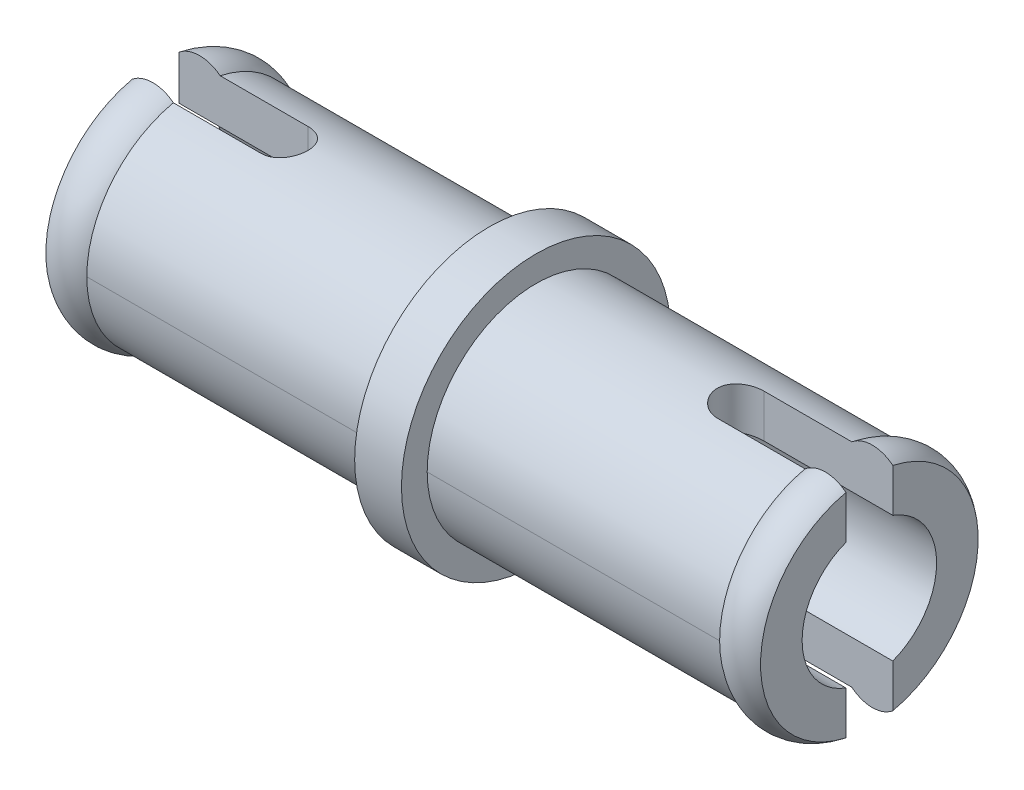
from build123d import *

# Parameters (mm, degrees)
SKETCH1_R           = 2.3622
BASE_EXTRUDE_DEPTH  = 7.239
SKETCH3_R           = 2.921
BOSS_EXTRUDE1_DEPTH = 1.016
SKETCH4_R           = 2.3876
BOSS_EXTRUDE2_DEPTH = 7.239
SKETCH7_R           = 1.4605
CUT_EXTRUDE2_DEPTH  = 17.035227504
CUT_EXTRUDE4_DEPTH  = 10.230899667


with BuildPart() as part:
    # Sketch1 → Base-Extrude (new body)
    with BuildSketch(Plane(origin=(0, 0, 0), x_dir=(0, 0, -1), z_dir=(1, 0, 0))):
        Circle(SKETCH1_R)
    extrude(amount=BASE_EXTRUDE_DEPTH)

    # Sketch3 → Boss-Extrude1 (add)
    with BuildSketch(Plane.ZY):
        Circle(SKETCH3_R)
    extrude(amount=BOSS_EXTRUDE1_DEPTH)

    # Sketch4 → Boss-Extrude2 (add)
    with BuildSketch(Plane.ZY.offset(1.016)):
        Circle(SKETCH4_R)
    extrude(amount=BOSS_EXTRUDE2_DEPTH)

    # Sketch6 → Boss-Revolve2 (revolve)
    with BuildSketch(Plane(origin=(0, 0, 0), x_dir=(1, 0, 0), z_dir=(0, 1, 0)), mode=Mode.PRIVATE) as boss_revolve2_sk:
        with BuildLine():
            Line((-8.255, 2.3876), (-7.366, 2.3876))
            ThreePointArc((-7.366, 2.3876), (-7.8105, 2.54), (-8.255, 2.3876))
        make_face()
    revolve(boss_revolve2_sk.sketch.rotate(Axis((0, 0, 0), (-1, 0, 0)), 180), axis=Axis((0, 0, 0), (-1, 0, 0)))

    # Sketch9 → Boss-Revolve3 (revolve)
    with BuildSketch(Plane(origin=(0, 0, 0), x_dir=(1, 0, 0), z_dir=(0, 1, 0)), mode=Mode.PRIVATE) as boss_revolve3_sk:
        with BuildLine():
            Line((6.35, 2.3622), (7.239, 2.3622))
            ThreePointArc((7.239, 2.3622), (6.7945, 2.520115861), (6.35, 2.3622))
        make_face()
    revolve(boss_revolve3_sk.sketch.rotate(Axis((0, 0, 0), (1, 0, 0)), 180), axis=Axis((0, 0, 0), (1, 0, 0)))

    # Sketch7 → Cut-Extrude2 (cut, through all)
    with BuildSketch(Plane.ZY.offset(8.255)):
        Circle(SKETCH7_R)
    extrude(amount=-CUT_EXTRUDE2_DEPTH, mode=Mode.SUBTRACT)

    # Sketch8 → Cut-Extrude4 (cut, symmetric)
    with BuildSketch(Plane(origin=(0, 0, 0), x_dir=(1, 0, 0), z_dir=(0, 1, 0))):
        with BuildLine():
            Line((-8.255, 0.508), (-5.461, 0.508))
            ThreePointArc((-5.461, 0.508), (-4.953, 0), (-5.461, -0.508))
            Line((-5.461, -0.508), (-8.255, -0.508))
            Line((-8.255, -0.508), (-8.255, 0.508))
        make_face()
    cut_extrude4 = extrude(amount=CUT_EXTRUDE4_DEPTH, both=True, mode=Mode.SUBTRACT)

    # Mirror7: Cut-Extrude4 across plane
    add(cut_extrude4.mirror(Plane(origin=(-0.508, 0, 0), x_dir=(0, 0, 1), z_dir=(1, 0, 0))), mode=Mode.SUBTRACT)


solid = part.part
